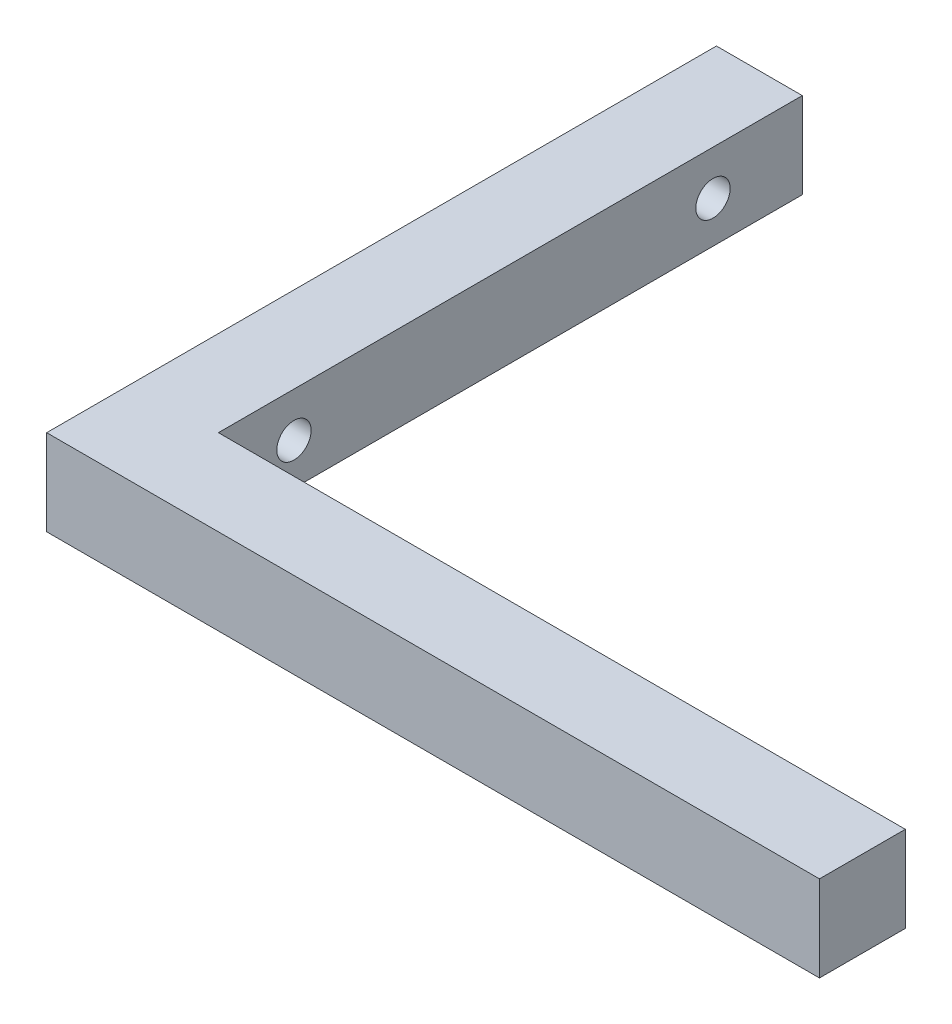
ISO-10303-21;
HEADER;
FILE_DESCRIPTION(('STEP AP214'),'2;1');
FILE_NAME('part.step','',(''),(''),'','','');
FILE_SCHEMA(('AUTOMOTIVE_DESIGN { 1 0 10303 214 1 1 1 1 }'));
ENDSEC;
DATA;
#1=APPLICATION_CONTEXT('core data for automotive mechanical design processes');
#2=APPLICATION_PROTOCOL_DEFINITION('international standard','automotive_design',2000,#1);
#3=PRODUCT_CONTEXT('',#1,'mechanical');
#4=PRODUCT('Part','Part','',(#3));
#5=PRODUCT_RELATED_PRODUCT_CATEGORY('part','',(#4));
#6=PRODUCT_DEFINITION_FORMATION('','',#4);
#7=PRODUCT_DEFINITION_CONTEXT('part definition',#1,'design');
#8=PRODUCT_DEFINITION('design','',#6,#7);
#9=PRODUCT_DEFINITION_SHAPE('','',#8);
#10=(LENGTH_UNIT() NAMED_UNIT(*) SI_UNIT(.MILLI.,.METRE.));
#11=(NAMED_UNIT(*) PLANE_ANGLE_UNIT() SI_UNIT($,.RADIAN.));
#12=(NAMED_UNIT(*) SI_UNIT($,.STERADIAN.) SOLID_ANGLE_UNIT());
#13=UNCERTAINTY_MEASURE_WITH_UNIT(LENGTH_MEASURE(1.E-05),#10,'distance_accuracy_value','');
#14=(GEOMETRIC_REPRESENTATION_CONTEXT(3) GLOBAL_UNCERTAINTY_ASSIGNED_CONTEXT((#13)) GLOBAL_UNIT_ASSIGNED_CONTEXT((#10,
#11,#12)) REPRESENTATION_CONTEXT('',''));
#15=CARTESIAN_POINT('',(0.,0.,0.));
#16=DIRECTION('',(0.,0.,1.));
#17=DIRECTION('',(1.,0.,0.));
#18=AXIS2_PLACEMENT_3D('',#15,#16,#17);
#19=CARTESIAN_POINT('',(0.,6.35,-6.35));
#20=DIRECTION('',(-1.,0.,0.));
#21=DIRECTION('',(0.,0.,1.));
#22=AXIS2_PLACEMENT_3D('',#19,#20,#21);
#23=PLANE('',#22);
#24=DIRECTION('',(0.,0.,-1.));
#25=VECTOR('',#24,1.);
#26=CARTESIAN_POINT('',(0.,0.,-6.35));
#27=LINE('',#26,#25);
#28=CARTESIAN_POINT('',(0.,0.,0.));
#29=VERTEX_POINT('',#28);
#30=CARTESIAN_POINT('',(0.,0.,-6.35));
#31=VERTEX_POINT('',#30);
#32=EDGE_CURVE('E134',#29,#31,#27,.T.);
#33=ORIENTED_EDGE('',*,*,#32,.T.);
#34=DIRECTION('',(0.,-1.,0.));
#35=VECTOR('',#34,1.);
#36=CARTESIAN_POINT('',(0.,6.35,-6.35));
#37=LINE('',#36,#35);
#38=CARTESIAN_POINT('',(0.,6.35,-6.35));
#39=VERTEX_POINT('',#38);
#40=EDGE_CURVE('E11',#39,#31,#37,.T.);
#41=ORIENTED_EDGE('',*,*,#40,.F.);
#42=DIRECTION('',(0.,0.,-1.));
#43=VECTOR('',#42,1.);
#44=CARTESIAN_POINT('',(0.,6.35,-6.35));
#45=LINE('',#44,#43);
#46=CARTESIAN_POINT('',(0.,6.35,0.));
#47=VERTEX_POINT('',#46);
#48=EDGE_CURVE('E151',#47,#39,#45,.T.);
#49=ORIENTED_EDGE('',*,*,#48,.F.);
#50=DIRECTION('',(0.,-1.,0.));
#51=VECTOR('',#50,1.);
#52=CARTESIAN_POINT('',(0.,6.35,0.));
#53=LINE('',#52,#51);
#54=EDGE_CURVE('E130',#47,#29,#53,.T.);
#55=ORIENTED_EDGE('',*,*,#54,.T.);
#56=EDGE_LOOP('',(#33,#41,#49,#55));
#57=FACE_BOUND('',#56,.T.);
#58=ADVANCED_FACE('F45',(#57),#23,.F.);
#59=CARTESIAN_POINT('',(-50.8,6.35,-6.35));
#60=DIRECTION('',(0.,0.,1.));
#61=DIRECTION('',(1.,0.,0.));
#62=AXIS2_PLACEMENT_3D('',#59,#60,#61);
#63=PLANE('',#62);
#64=DIRECTION('',(-1.,0.,0.));
#65=VECTOR('',#64,1.);
#66=CARTESIAN_POINT('',(-50.8,0.,-6.35));
#67=LINE('',#66,#65);
#68=CARTESIAN_POINT('',(-50.8,0.,-6.35));
#69=VERTEX_POINT('',#68);
#70=EDGE_CURVE('E138',#31,#69,#67,.T.);
#71=ORIENTED_EDGE('',*,*,#70,.T.);
#72=DIRECTION('',(0.,-1.,0.));
#73=VECTOR('',#72,1.);
#74=CARTESIAN_POINT('',(-50.8,6.35,-6.35));
#75=LINE('',#74,#73);
#76=CARTESIAN_POINT('',(-50.8,6.35,-6.35));
#77=VERTEX_POINT('',#76);
#78=EDGE_CURVE('E54',#77,#69,#75,.T.);
#79=ORIENTED_EDGE('',*,*,#78,.F.);
#80=DIRECTION('',(-1.,0.,0.));
#81=VECTOR('',#80,1.);
#82=CARTESIAN_POINT('',(-50.8,6.35,-6.35));
#83=LINE('',#82,#81);
#84=EDGE_CURVE('E99',#39,#77,#83,.T.);
#85=ORIENTED_EDGE('',*,*,#84,.F.);
#86=ORIENTED_EDGE('',*,*,#40,.T.);
#87=EDGE_LOOP('',(#71,#79,#85,#86));
#88=FACE_BOUND('',#87,.T.);
#89=ADVANCED_FACE('F181',(#88),#63,.F.);
#90=CARTESIAN_POINT('',(-50.8,6.35,-49.53));
#91=DIRECTION('',(-1.,0.,0.));
#92=DIRECTION('',(0.,0.,1.));
#93=AXIS2_PLACEMENT_3D('',#90,#91,#92);
#94=PLANE('',#93);
#95=CARTESIAN_POINT('',(-50.8,3.07272511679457,-42.926));
#96=DIRECTION('',(-1.,0.,0.));
#97=DIRECTION('',(0.,0.,1.));
#98=AXIS2_PLACEMENT_3D('',#95,#96,#97);
#99=CIRCLE('',#98,1.27);
#100=CARTESIAN_POINT('',(-50.8,3.07272511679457,-41.656));
#101=VERTEX_POINT('',#100);
#102=EDGE_CURVE('E139',#101,#101,#99,.T.);
#103=ORIENTED_EDGE('',*,*,#102,.T.);
#104=EDGE_LOOP('',(#103));
#105=FACE_BOUND('',#104,.T.);
#106=CARTESIAN_POINT('',(-50.8,3.07272511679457,-11.938));
#107=DIRECTION('',(-1.,0.,0.));
#108=DIRECTION('',(0.,0.,1.));
#109=AXIS2_PLACEMENT_3D('',#106,#107,#108);
#110=CIRCLE('',#109,1.27);
#111=CARTESIAN_POINT('',(-50.8,3.07272511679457,-10.668));
#112=VERTEX_POINT('',#111);
#113=EDGE_CURVE('E251',#112,#112,#110,.T.);
#114=ORIENTED_EDGE('',*,*,#113,.T.);
#115=EDGE_LOOP('',(#114));
#116=FACE_BOUND('',#115,.T.);
#117=DIRECTION('',(0.,0.,-1.));
#118=VECTOR('',#117,1.);
#119=CARTESIAN_POINT('',(-50.8,0.,-49.53));
#120=LINE('',#119,#118);
#121=CARTESIAN_POINT('',(-50.8,0.,-49.53));
#122=VERTEX_POINT('',#121);
#123=EDGE_CURVE('E142',#69,#122,#120,.T.);
#124=ORIENTED_EDGE('',*,*,#123,.T.);
#125=DIRECTION('',(0.,-1.,0.));
#126=VECTOR('',#125,1.);
#127=CARTESIAN_POINT('',(-50.8,6.35,-49.53));
#128=LINE('',#127,#126);
#129=CARTESIAN_POINT('',(-50.8,6.35,-49.53));
#130=VERTEX_POINT('',#129);
#131=EDGE_CURVE('E123',#130,#122,#128,.T.);
#132=ORIENTED_EDGE('',*,*,#131,.F.);
#133=DIRECTION('',(0.,0.,-1.));
#134=VECTOR('',#133,1.);
#135=CARTESIAN_POINT('',(-50.8,6.35,-49.53));
#136=LINE('',#135,#134);
#137=EDGE_CURVE('E112',#77,#130,#136,.T.);
#138=ORIENTED_EDGE('',*,*,#137,.F.);
#139=ORIENTED_EDGE('',*,*,#78,.T.);
#140=EDGE_LOOP('',(#124,#132,#138,#139));
#141=FACE_BOUND('',#140,.T.);
#142=ADVANCED_FACE('F161',(#105,#116,#141),#94,.F.);
#143=CARTESIAN_POINT('',(-57.15,6.35,-49.53));
#144=DIRECTION('',(0.,0.,1.));
#145=DIRECTION('',(1.,0.,0.));
#146=AXIS2_PLACEMENT_3D('',#143,#144,#145);
#147=PLANE('',#146);
#148=DIRECTION('',(-1.,0.,0.));
#149=VECTOR('',#148,1.);
#150=CARTESIAN_POINT('',(-57.15,0.,-49.53));
#151=LINE('',#150,#149);
#152=CARTESIAN_POINT('',(-57.15,0.,-49.53));
#153=VERTEX_POINT('',#152);
#154=EDGE_CURVE('E121',#122,#153,#151,.T.);
#155=ORIENTED_EDGE('',*,*,#154,.T.);
#156=DIRECTION('',(0.,-1.,0.));
#157=VECTOR('',#156,1.);
#158=CARTESIAN_POINT('',(-57.15,6.35,-49.53));
#159=LINE('',#158,#157);
#160=CARTESIAN_POINT('',(-57.15,6.35,-49.53));
#161=VERTEX_POINT('',#160);
#162=EDGE_CURVE('E118',#161,#153,#159,.T.);
#163=ORIENTED_EDGE('',*,*,#162,.F.);
#164=DIRECTION('',(-1.,0.,0.));
#165=VECTOR('',#164,1.);
#166=CARTESIAN_POINT('',(-57.15,6.35,-49.53));
#167=LINE('',#166,#165);
#168=EDGE_CURVE('E106',#130,#161,#167,.T.);
#169=ORIENTED_EDGE('',*,*,#168,.F.);
#170=ORIENTED_EDGE('',*,*,#131,.T.);
#171=EDGE_LOOP('',(#155,#163,#169,#170));
#172=FACE_BOUND('',#171,.T.);
#173=ADVANCED_FACE('F119',(#172),#147,.F.);
#174=CARTESIAN_POINT('',(-57.15,6.35,0.));
#175=DIRECTION('',(1.,0.,0.));
#176=DIRECTION('',(0.,0.,-1.));
#177=AXIS2_PLACEMENT_3D('',#174,#175,#176);
#178=PLANE('',#177);
#179=CARTESIAN_POINT('',(-57.15,3.07272511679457,-42.926));
#180=DIRECTION('',(-1.,0.,0.));
#181=DIRECTION('',(0.,0.,1.));
#182=AXIS2_PLACEMENT_3D('',#179,#180,#181);
#183=CIRCLE('',#182,1.27);
#184=CARTESIAN_POINT('',(-57.15,3.07272511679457,-41.656));
#185=VERTEX_POINT('',#184);
#186=EDGE_CURVE('E249',#185,#185,#183,.T.);
#187=ORIENTED_EDGE('',*,*,#186,.F.);
#188=EDGE_LOOP('',(#187));
#189=FACE_BOUND('',#188,.T.);
#190=CARTESIAN_POINT('',(-57.15,3.07272511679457,-11.938));
#191=DIRECTION('',(-1.,0.,0.));
#192=DIRECTION('',(0.,0.,1.));
#193=AXIS2_PLACEMENT_3D('',#190,#191,#192);
#194=CIRCLE('',#193,1.27);
#195=CARTESIAN_POINT('',(-57.15,3.07272511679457,-10.668));
#196=VERTEX_POINT('',#195);
#197=EDGE_CURVE('E257',#196,#196,#194,.T.);
#198=ORIENTED_EDGE('',*,*,#197,.F.);
#199=EDGE_LOOP('',(#198));
#200=FACE_BOUND('',#199,.T.);
#201=DIRECTION('',(0.,0.,1.));
#202=VECTOR('',#201,1.);
#203=CARTESIAN_POINT('',(-57.15,0.,0.));
#204=LINE('',#203,#202);
#205=CARTESIAN_POINT('',(-57.15,0.,0.));
#206=VERTEX_POINT('',#205);
#207=EDGE_CURVE('E85',#153,#206,#204,.T.);
#208=ORIENTED_EDGE('',*,*,#207,.T.);
#209=DIRECTION('',(0.,-1.,0.));
#210=VECTOR('',#209,1.);
#211=CARTESIAN_POINT('',(-57.15,6.35,0.));
#212=LINE('',#211,#210);
#213=CARTESIAN_POINT('',(-57.15,6.35,0.));
#214=VERTEX_POINT('',#213);
#215=EDGE_CURVE('E124',#214,#206,#212,.T.);
#216=ORIENTED_EDGE('',*,*,#215,.F.);
#217=DIRECTION('',(0.,0.,1.));
#218=VECTOR('',#217,1.);
#219=CARTESIAN_POINT('',(-57.15,6.35,0.));
#220=LINE('',#219,#218);
#221=EDGE_CURVE('E110',#161,#214,#220,.T.);
#222=ORIENTED_EDGE('',*,*,#221,.F.);
#223=ORIENTED_EDGE('',*,*,#162,.T.);
#224=EDGE_LOOP('',(#208,#216,#222,#223));
#225=FACE_BOUND('',#224,.T.);
#226=ADVANCED_FACE('F126',(#189,#200,#225),#178,.F.);
#227=CARTESIAN_POINT('',(0.,6.35,0.));
#228=DIRECTION('',(0.,0.,-1.));
#229=DIRECTION('',(-1.,0.,0.));
#230=AXIS2_PLACEMENT_3D('',#227,#228,#229);
#231=PLANE('',#230);
#232=DIRECTION('',(1.,0.,0.));
#233=VECTOR('',#232,1.);
#234=CARTESIAN_POINT('',(0.,0.,0.));
#235=LINE('',#234,#233);
#236=EDGE_CURVE('E91',#206,#29,#235,.T.);
#237=ORIENTED_EDGE('',*,*,#236,.T.);
#238=ORIENTED_EDGE('',*,*,#54,.F.);
#239=DIRECTION('',(1.,0.,0.));
#240=VECTOR('',#239,1.);
#241=CARTESIAN_POINT('',(0.,6.35,0.));
#242=LINE('',#241,#240);
#243=EDGE_CURVE('E62',#214,#47,#242,.T.);
#244=ORIENTED_EDGE('',*,*,#243,.F.);
#245=ORIENTED_EDGE('',*,*,#215,.T.);
#246=EDGE_LOOP('',(#237,#238,#244,#245));
#247=FACE_BOUND('',#246,.T.);
#248=ADVANCED_FACE('F168',(#247),#231,.F.);
#249=CARTESIAN_POINT('',(0.,6.35,0.));
#250=DIRECTION('',(0.,-1.,0.));
#251=DIRECTION('',(0.,0.,-1.));
#252=AXIS2_PLACEMENT_3D('',#249,#250,#251);
#253=PLANE('',#252);
#254=ORIENTED_EDGE('',*,*,#48,.T.);
#255=ORIENTED_EDGE('',*,*,#84,.T.);
#256=ORIENTED_EDGE('',*,*,#137,.T.);
#257=ORIENTED_EDGE('',*,*,#168,.T.);
#258=ORIENTED_EDGE('',*,*,#221,.T.);
#259=ORIENTED_EDGE('',*,*,#243,.T.);
#260=EDGE_LOOP('',(#254,#255,#256,#257,#258,#259));
#261=FACE_BOUND('',#260,.T.);
#262=ADVANCED_FACE('F108',(#261),#253,.F.);
#263=CARTESIAN_POINT('',(0.,0.,0.));
#264=DIRECTION('',(0.,-1.,0.));
#265=DIRECTION('',(0.,0.,-1.));
#266=AXIS2_PLACEMENT_3D('',#263,#264,#265);
#267=PLANE('',#266);
#268=ORIENTED_EDGE('',*,*,#32,.F.);
#269=ORIENTED_EDGE('',*,*,#236,.F.);
#270=ORIENTED_EDGE('',*,*,#207,.F.);
#271=ORIENTED_EDGE('',*,*,#154,.F.);
#272=ORIENTED_EDGE('',*,*,#123,.F.);
#273=ORIENTED_EDGE('',*,*,#70,.F.);
#274=EDGE_LOOP('',(#268,#269,#270,#271,#272,#273));
#275=FACE_BOUND('',#274,.T.);
#276=ADVANCED_FACE('F164',(#275),#267,.T.);
#277=CARTESIAN_POINT('',(-50.8,3.07272511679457,-11.938));
#278=DIRECTION('',(-1.,0.,0.));
#279=DIRECTION('',(0.,0.,1.));
#280=AXIS2_PLACEMENT_3D('',#277,#278,#279);
#281=CYLINDRICAL_SURFACE('',#280,1.27);
#282=ORIENTED_EDGE('',*,*,#113,.F.);
#283=EDGE_LOOP('',(#282));
#284=FACE_BOUND('',#283,.T.);
#285=ORIENTED_EDGE('',*,*,#197,.T.);
#286=EDGE_LOOP('',(#285));
#287=FACE_BOUND('',#286,.T.);
#288=ADVANCED_FACE('F224',(#284,#287),#281,.F.);
#289=CARTESIAN_POINT('',(-50.8,3.07272511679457,-42.926));
#290=DIRECTION('',(-1.,0.,0.));
#291=DIRECTION('',(0.,0.,1.));
#292=AXIS2_PLACEMENT_3D('',#289,#290,#291);
#293=CYLINDRICAL_SURFACE('',#292,1.27);
#294=ORIENTED_EDGE('',*,*,#102,.F.);
#295=EDGE_LOOP('',(#294));
#296=FACE_BOUND('',#295,.T.);
#297=ORIENTED_EDGE('',*,*,#186,.T.);
#298=EDGE_LOOP('',(#297));
#299=FACE_BOUND('',#298,.T.);
#300=ADVANCED_FACE('F231',(#296,#299),#293,.F.);
#301=CLOSED_SHELL('',(#58,#89,#142,#173,#226,#248,#262,#276,#288,#300));
#302=MANIFOLD_SOLID_BREP('B2',#301);
#303=ADVANCED_BREP_SHAPE_REPRESENTATION('',(#18,#302),#14);
#304=SHAPE_DEFINITION_REPRESENTATION(#9,#303);
ENDSEC;
END-ISO-10303-21;
